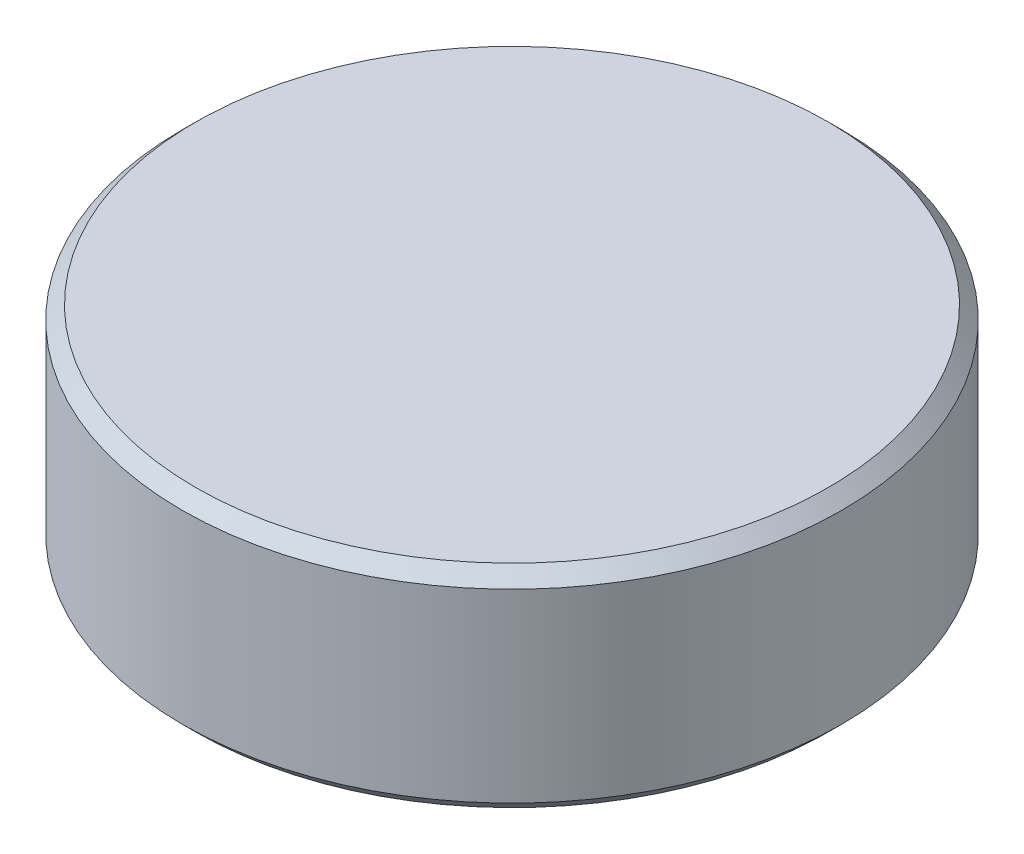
ISO-10303-21;
HEADER;
FILE_DESCRIPTION(('STEP AP214'),'2;1');
FILE_NAME('part.step','',(''),(''),'','','');
FILE_SCHEMA(('AUTOMOTIVE_DESIGN { 1 0 10303 214 1 1 1 1 }'));
ENDSEC;
DATA;
#1=APPLICATION_CONTEXT('core data for automotive mechanical design processes');
#2=APPLICATION_PROTOCOL_DEFINITION('international standard','automotive_design',2000,#1);
#3=PRODUCT_CONTEXT('',#1,'mechanical');
#4=PRODUCT('Part','Part','',(#3));
#5=PRODUCT_RELATED_PRODUCT_CATEGORY('part','',(#4));
#6=PRODUCT_DEFINITION_FORMATION('','',#4);
#7=PRODUCT_DEFINITION_CONTEXT('part definition',#1,'design');
#8=PRODUCT_DEFINITION('design','',#6,#7);
#9=PRODUCT_DEFINITION_SHAPE('','',#8);
#10=(LENGTH_UNIT() NAMED_UNIT(*) SI_UNIT(.MILLI.,.METRE.));
#11=(NAMED_UNIT(*) PLANE_ANGLE_UNIT() SI_UNIT($,.RADIAN.));
#12=(NAMED_UNIT(*) SI_UNIT($,.STERADIAN.) SOLID_ANGLE_UNIT());
#13=UNCERTAINTY_MEASURE_WITH_UNIT(LENGTH_MEASURE(1.E-05),#10,'distance_accuracy_value','');
#14=(GEOMETRIC_REPRESENTATION_CONTEXT(3) GLOBAL_UNCERTAINTY_ASSIGNED_CONTEXT((#13)) GLOBAL_UNIT_ASSIGNED_CONTEXT((#10,
#11,#12)) REPRESENTATION_CONTEXT('',''));
#15=CARTESIAN_POINT('',(0.,0.,0.));
#16=DIRECTION('',(0.,0.,1.));
#17=DIRECTION('',(1.,0.,0.));
#18=AXIS2_PLACEMENT_3D('',#15,#16,#17);
#19=CARTESIAN_POINT('',(0.,0.,0.));
#20=DIRECTION('',(0.,1.,0.));
#21=DIRECTION('',(0.,0.,1.));
#22=AXIS2_PLACEMENT_3D('',#19,#20,#21);
#23=PLANE('',#22);
#24=CARTESIAN_POINT('',(0.,0.,0.));
#25=DIRECTION('',(0.,1.,0.));
#26=DIRECTION('',(0.,0.,1.));
#27=AXIS2_PLACEMENT_3D('',#24,#25,#26);
#28=CIRCLE('',#27,7.17499999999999);
#29=CARTESIAN_POINT('',(0.,0.,7.17499999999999));
#30=VERTEX_POINT('',#29);
#31=EDGE_CURVE('E10',#30,#30,#28,.F.);
#32=ORIENTED_EDGE('',*,*,#31,.T.);
#33=EDGE_LOOP('',(#32));
#34=FACE_BOUND('',#33,.T.);
#35=CARTESIAN_POINT('',(0.,0.,0.));
#36=DIRECTION('',(0.,-1.,0.));
#37=DIRECTION('',(0.,0.,-1.));
#38=AXIS2_PLACEMENT_3D('',#35,#36,#37);
#39=CIRCLE('',#38,1.5);
#40=CARTESIAN_POINT('',(0.,0.,-1.5));
#41=VERTEX_POINT('',#40);
#42=EDGE_CURVE('E61',#41,#41,#39,.T.);
#43=ORIENTED_EDGE('',*,*,#42,.F.);
#44=EDGE_LOOP('',(#43));
#45=FACE_BOUND('',#44,.T.);
#46=ADVANCED_FACE('F37',(#34,#45),#23,.F.);
#47=CARTESIAN_POINT('',(0.,4.,0.));
#48=DIRECTION('',(0.,-1.,0.));
#49=DIRECTION('',(0.,0.,-1.));
#50=AXIS2_PLACEMENT_3D('',#47,#48,#49);
#51=CYLINDRICAL_SURFACE('',#50,7.475);
#52=CARTESIAN_POINT('',(0.,4.5,0.));
#53=DIRECTION('',(0.,1.,0.));
#54=DIRECTION('',(0.,0.,1.));
#55=AXIS2_PLACEMENT_3D('',#52,#53,#54);
#56=CIRCLE('',#55,7.475);
#57=CARTESIAN_POINT('',(0.,4.5,7.475));
#58=VERTEX_POINT('',#57);
#59=EDGE_CURVE('E50',#58,#58,#56,.F.);
#60=ORIENTED_EDGE('',*,*,#59,.T.);
#61=EDGE_LOOP('',(#60));
#62=FACE_BOUND('',#61,.T.);
#63=CARTESIAN_POINT('',(0.,0.300000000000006,0.));
#64=DIRECTION('',(0.,1.,0.));
#65=DIRECTION('',(0.,0.,1.));
#66=AXIS2_PLACEMENT_3D('',#63,#64,#65);
#67=CIRCLE('',#66,7.475);
#68=CARTESIAN_POINT('',(0.,0.300000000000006,7.475));
#69=VERTEX_POINT('',#68);
#70=EDGE_CURVE('E55',#69,#69,#67,.T.);
#71=ORIENTED_EDGE('',*,*,#70,.T.);
#72=EDGE_LOOP('',(#71));
#73=FACE_BOUND('',#72,.T.);
#74=ADVANCED_FACE('F80',(#62,#73),#51,.T.);
#75=CARTESIAN_POINT('',(0.,4.8,0.));
#76=DIRECTION('',(0.,1.,0.));
#77=DIRECTION('',(0.,0.,1.));
#78=AXIS2_PLACEMENT_3D('',#75,#76,#77);
#79=PLANE('',#78);
#80=CARTESIAN_POINT('',(0.,4.8,0.));
#81=DIRECTION('',(0.,1.,0.));
#82=DIRECTION('',(0.,0.,1.));
#83=AXIS2_PLACEMENT_3D('',#80,#81,#82);
#84=CIRCLE('',#83,7.175);
#85=CARTESIAN_POINT('',(0.,4.8,7.175));
#86=VERTEX_POINT('',#85);
#87=EDGE_CURVE('E45',#86,#86,#84,.T.);
#88=ORIENTED_EDGE('',*,*,#87,.T.);
#89=EDGE_LOOP('',(#88));
#90=FACE_BOUND('',#89,.T.);
#91=ADVANCED_FACE('F75',(#90),#79,.T.);
#92=CARTESIAN_POINT('',(0.,-1.,0.));
#93=DIRECTION('',(0.,1.,0.));
#94=DIRECTION('',(0.,0.,1.));
#95=AXIS2_PLACEMENT_3D('',#92,#93,#94);
#96=CYLINDRICAL_SURFACE('',#95,1.5);
#97=CARTESIAN_POINT('',(0.,-1.,0.));
#98=DIRECTION('',(0.,-1.,0.));
#99=DIRECTION('',(0.,0.,-1.));
#100=AXIS2_PLACEMENT_3D('',#97,#98,#99);
#101=CIRCLE('',#100,1.5);
#102=CARTESIAN_POINT('',(0.,-1.,-1.5));
#103=VERTEX_POINT('',#102);
#104=EDGE_CURVE('E65',#103,#103,#101,.T.);
#105=ORIENTED_EDGE('',*,*,#104,.F.);
#106=EDGE_LOOP('',(#105));
#107=FACE_BOUND('',#106,.T.);
#108=ORIENTED_EDGE('',*,*,#42,.T.);
#109=EDGE_LOOP('',(#108));
#110=FACE_BOUND('',#109,.T.);
#111=ADVANCED_FACE('F72',(#107,#110),#96,.T.);
#112=CARTESIAN_POINT('',(0.,-1.,0.));
#113=DIRECTION('',(0.,-1.,0.));
#114=DIRECTION('',(0.,0.,-1.));
#115=AXIS2_PLACEMENT_3D('',#112,#113,#114);
#116=PLANE('',#115);
#117=ORIENTED_EDGE('',*,*,#104,.T.);
#118=EDGE_LOOP('',(#117));
#119=FACE_BOUND('',#118,.T.);
#120=ADVANCED_FACE('F70',(#119),#116,.T.);
#121=CARTESIAN_POINT('',(0.,4.5,0.));
#122=DIRECTION('',(0.,-1.,0.));
#123=DIRECTION('',(0.,0.,-1.));
#124=AXIS2_PLACEMENT_3D('',#121,#122,#123);
#125=CONICAL_SURFACE('',#124,7.475,0.78539816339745);
#126=ORIENTED_EDGE('',*,*,#87,.F.);
#127=EDGE_LOOP('',(#126));
#128=FACE_BOUND('',#127,.T.);
#129=ORIENTED_EDGE('',*,*,#59,.F.);
#130=EDGE_LOOP('',(#129));
#131=FACE_BOUND('',#130,.T.);
#132=ADVANCED_FACE('F89',(#128,#131),#125,.T.);
#133=CARTESIAN_POINT('',(0.,0.300000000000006,0.));
#134=DIRECTION('',(0.,1.,0.));
#135=DIRECTION('',(0.,0.,1.));
#136=AXIS2_PLACEMENT_3D('',#133,#134,#135);
#137=CONICAL_SURFACE('',#136,7.475,0.785398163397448);
#138=ORIENTED_EDGE('',*,*,#31,.F.);
#139=EDGE_LOOP('',(#138));
#140=FACE_BOUND('',#139,.T.);
#141=ORIENTED_EDGE('',*,*,#70,.F.);
#142=EDGE_LOOP('',(#141));
#143=FACE_BOUND('',#142,.T.);
#144=ADVANCED_FACE('F39',(#140,#143),#137,.T.);
#145=CLOSED_SHELL('',(#46,#74,#91,#111,#120,#132,#144));
#146=MANIFOLD_SOLID_BREP('B2',#145);
#147=ADVANCED_BREP_SHAPE_REPRESENTATION('',(#18,#146),#14);
#148=SHAPE_DEFINITION_REPRESENTATION(#9,#147);
ENDSEC;
END-ISO-10303-21;
